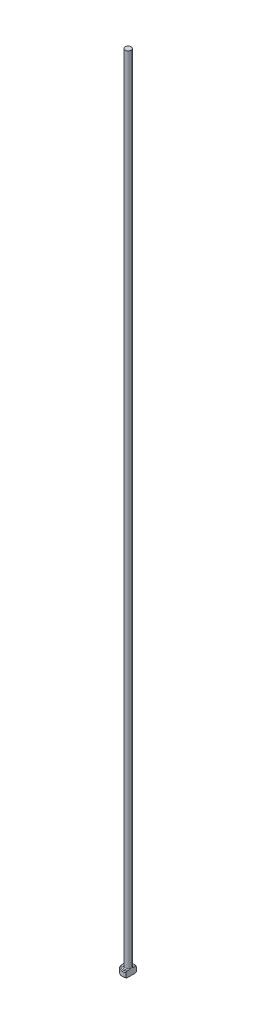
ISO-10303-21;
HEADER;
FILE_DESCRIPTION(('STEP AP214'),'2;1');
FILE_NAME('part.step','',(''),(''),'','','');
FILE_SCHEMA(('AUTOMOTIVE_DESIGN { 1 0 10303 214 1 1 1 1 }'));
ENDSEC;
DATA;
#1=APPLICATION_CONTEXT('core data for automotive mechanical design processes');
#2=APPLICATION_PROTOCOL_DEFINITION('international standard','automotive_design',2000,#1);
#3=PRODUCT_CONTEXT('',#1,'mechanical');
#4=PRODUCT('Part','Part','',(#3));
#5=PRODUCT_RELATED_PRODUCT_CATEGORY('part','',(#4));
#6=PRODUCT_DEFINITION_FORMATION('','',#4);
#7=PRODUCT_DEFINITION_CONTEXT('part definition',#1,'design');
#8=PRODUCT_DEFINITION('design','',#6,#7);
#9=PRODUCT_DEFINITION_SHAPE('','',#8);
#10=(LENGTH_UNIT() NAMED_UNIT(*) SI_UNIT(.MILLI.,.METRE.));
#11=(NAMED_UNIT(*) PLANE_ANGLE_UNIT() SI_UNIT($,.RADIAN.));
#12=(NAMED_UNIT(*) SI_UNIT($,.STERADIAN.) SOLID_ANGLE_UNIT());
#13=UNCERTAINTY_MEASURE_WITH_UNIT(LENGTH_MEASURE(1.E-05),#10,'distance_accuracy_value','');
#14=(GEOMETRIC_REPRESENTATION_CONTEXT(3) GLOBAL_UNCERTAINTY_ASSIGNED_CONTEXT((#13)) GLOBAL_UNIT_ASSIGNED_CONTEXT((#10,
#11,#12)) REPRESENTATION_CONTEXT('',''));
#15=CARTESIAN_POINT('',(0.,0.,0.));
#16=DIRECTION('',(0.,0.,1.));
#17=DIRECTION('',(1.,0.,0.));
#18=AXIS2_PLACEMENT_3D('',#15,#16,#17);
#19=CARTESIAN_POINT('',(0.,0.,0.));
#20=DIRECTION('',(0.,-1.,0.));
#21=DIRECTION('',(0.,0.,-1.));
#22=AXIS2_PLACEMENT_3D('',#19,#20,#21);
#23=PLANE('',#22);
#24=CARTESIAN_POINT('',(0.,0.,0.));
#25=DIRECTION('',(0.,-1.,0.));
#26=DIRECTION('',(0.,0.,-1.));
#27=AXIS2_PLACEMENT_3D('',#24,#25,#26);
#28=CIRCLE('',#27,1.29999999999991);
#29=CARTESIAN_POINT('',(0.749999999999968,0.,1.06183802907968));
#30=VERTEX_POINT('',#29);
#31=CARTESIAN_POINT('',(0.749999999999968,0.,-1.06183802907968));
#32=VERTEX_POINT('',#31);
#33=EDGE_CURVE('E98',#30,#32,#28,.T.);
#34=ORIENTED_EDGE('',*,*,#33,.T.);
#35=DIRECTION('',(0.,0.,1.));
#36=VECTOR('',#35,1.);
#37=CARTESIAN_POINT('',(0.749999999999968,0.,-1.29903810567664));
#38=LINE('',#37,#36);
#39=EDGE_CURVE('E83',#32,#30,#38,.T.);
#40=ORIENTED_EDGE('',*,*,#39,.T.);
#41=EDGE_LOOP('',(#34,#40));
#42=FACE_BOUND('',#41,.T.);
#43=ADVANCED_FACE('F32',(#42),#23,.T.);
#44=CARTESIAN_POINT('',(0.,259.958771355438,0.));
#45=DIRECTION('',(0.,1.,0.));
#46=DIRECTION('',(0.,0.,1.));
#47=AXIS2_PLACEMENT_3D('',#44,#45,#46);
#48=CYLINDRICAL_SURFACE('',#47,1.49999999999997);
#49=CARTESIAN_POINT('',(0.,1.30000000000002,0.));
#50=DIRECTION('',(0.,1.,0.));
#51=DIRECTION('',(0.,0.,1.));
#52=AXIS2_PLACEMENT_3D('',#49,#50,#51);
#53=CIRCLE('',#52,1.49999999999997);
#54=CARTESIAN_POINT('',(0.749999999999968,1.30000000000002,1.29903810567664));
#55=VERTEX_POINT('',#54);
#56=CARTESIAN_POINT('',(0.749999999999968,1.30000000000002,-1.29903810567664));
#57=VERTEX_POINT('',#56);
#58=EDGE_CURVE('E104',#55,#57,#53,.F.);
#59=ORIENTED_EDGE('',*,*,#58,.T.);
#60=DIRECTION('',(0.,-1.,0.));
#61=VECTOR('',#60,1.);
#62=CARTESIAN_POINT('',(0.749999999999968,200.,-1.29903810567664));
#63=LINE('',#62,#61);
#64=CARTESIAN_POINT('',(0.749999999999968,0.200000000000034,-1.29903810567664));
#65=VERTEX_POINT('',#64);
#66=EDGE_CURVE('E183',#57,#65,#63,.T.);
#67=ORIENTED_EDGE('',*,*,#66,.T.);
#68=CARTESIAN_POINT('',(0.,0.200000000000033,0.));
#69=DIRECTION('',(0.,-1.,0.));
#70=DIRECTION('',(0.,0.,-1.));
#71=AXIS2_PLACEMENT_3D('',#68,#69,#70);
#72=CIRCLE('',#71,1.49999999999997);
#73=CARTESIAN_POINT('',(0.749999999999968,0.200000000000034,1.29903810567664));
#74=VERTEX_POINT('',#73);
#75=EDGE_CURVE('E100',#65,#74,#72,.F.);
#76=ORIENTED_EDGE('',*,*,#75,.T.);
#77=DIRECTION('',(0.,-1.,0.));
#78=VECTOR('',#77,1.);
#79=CARTESIAN_POINT('',(0.749999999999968,200.,1.29903810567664));
#80=LINE('',#79,#78);
#81=EDGE_CURVE('E93',#55,#74,#80,.T.);
#82=ORIENTED_EDGE('',*,*,#81,.F.);
#83=EDGE_LOOP('',(#59,#67,#76,#82));
#84=FACE_BOUND('',#83,.T.);
#85=ADVANCED_FACE('F158',(#84),#48,.T.);
#86=CARTESIAN_POINT('',(-1.49999999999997,1.5,0.));
#87=DIRECTION('',(0.,1.,0.));
#88=DIRECTION('',(0.,0.,1.));
#89=AXIS2_PLACEMENT_3D('',#86,#87,#88);
#90=PLANE('',#89);
#91=CARTESIAN_POINT('',(0.,1.5,0.));
#92=DIRECTION('',(0.,1.,0.));
#93=DIRECTION('',(0.,0.,1.));
#94=AXIS2_PLACEMENT_3D('',#91,#92,#93);
#95=CIRCLE('',#94,1.30000000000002);
#96=CARTESIAN_POINT('',(0.749999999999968,1.5,-1.06183802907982));
#97=VERTEX_POINT('',#96);
#98=CARTESIAN_POINT('',(0.749999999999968,1.5,1.06183802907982));
#99=VERTEX_POINT('',#98);
#100=EDGE_CURVE('E178',#97,#99,#95,.T.);
#101=ORIENTED_EDGE('',*,*,#100,.T.);
#102=DIRECTION('',(0.,0.,-1.));
#103=VECTOR('',#102,1.);
#104=CARTESIAN_POINT('',(0.749999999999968,1.5,0.));
#105=LINE('',#104,#103);
#106=CARTESIAN_POINT('',(0.749999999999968,1.49999999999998,0.583095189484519));
#107=VERTEX_POINT('',#106);
#108=EDGE_CURVE('E57',#99,#107,#105,.T.);
#109=ORIENTED_EDGE('',*,*,#108,.T.);
#110=CARTESIAN_POINT('',(0.,1.5,0.));
#111=DIRECTION('',(0.,1.,0.));
#112=DIRECTION('',(0.,0.,1.));
#113=AXIS2_PLACEMENT_3D('',#110,#111,#112);
#114=CIRCLE('',#113,0.949999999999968);
#115=CARTESIAN_POINT('',(0.749999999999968,1.49999999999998,-0.583095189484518));
#116=VERTEX_POINT('',#115);
#117=EDGE_CURVE('E107',#107,#116,#114,.F.);
#118=ORIENTED_EDGE('',*,*,#117,.T.);
#119=EDGE_CURVE('E136',#116,#97,#105,.T.);
#120=ORIENTED_EDGE('',*,*,#119,.T.);
#121=EDGE_LOOP('',(#101,#109,#118,#120));
#122=FACE_BOUND('',#121,.T.);
#123=ADVANCED_FACE('F147',(#122),#90,.T.);
#124=CARTESIAN_POINT('',(0.,1.5,0.));
#125=DIRECTION('',(0.,-1.,0.));
#126=DIRECTION('',(0.,0.,-1.));
#127=AXIS2_PLACEMENT_3D('',#124,#125,#126);
#128=CONICAL_SURFACE('',#127,1.30000000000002,0.785398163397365);
#129=ORIENTED_EDGE('',*,*,#58,.F.);
#130=CARTESIAN_POINT('',(0.749999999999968,-0.159311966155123,2.86269581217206));
#131=CARTESIAN_POINT('',(0.749999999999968,-0.0964328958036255,2.79769204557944));
#132=CARTESIAN_POINT('',(0.749999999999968,-0.0336221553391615,2.73262201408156));
#133=CARTESIAN_POINT('',(0.749999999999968,0.0918244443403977,2.6023120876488));
#134=CARTESIAN_POINT('',(0.749999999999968,0.154460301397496,2.53707219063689));
#135=CARTESIAN_POINT('',(0.749999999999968,0.342109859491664,2.34097725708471));
#136=CARTESIAN_POINT('',(0.749999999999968,0.466801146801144,2.20981339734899));
#137=CARTESIAN_POINT('',(0.749999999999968,0.712328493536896,1.9488034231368));
#138=CARTESIAN_POINT('',(0.749999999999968,0.833191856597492,1.81898315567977));
#139=CARTESIAN_POINT('',(0.749999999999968,1.01264761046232,1.6225957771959));
#140=CARTESIAN_POINT('',(0.749999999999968,1.07215326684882,1.55686440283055));
#141=CARTESIAN_POINT('',(0.749999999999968,1.19029260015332,1.42462307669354));
#142=CARTESIAN_POINT('',(0.749999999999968,1.24892630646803,1.35811315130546));
#143=CARTESIAN_POINT('',(0.749999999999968,1.34237202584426,1.25003987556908));
#144=CARTESIAN_POINT('',(0.749999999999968,1.37758720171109,1.2088255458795));
#145=CARTESIAN_POINT('',(0.749999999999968,1.44738925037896,1.12585980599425));
#146=CARTESIAN_POINT('',(0.749999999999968,1.4819760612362,1.08410834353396));
#147=CARTESIAN_POINT('',(0.749999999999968,1.55066668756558,0.999475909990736));
#148=CARTESIAN_POINT('',(0.749999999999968,1.58476158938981,0.956587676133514));
#149=CARTESIAN_POINT('',(0.749999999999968,1.65176028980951,0.869892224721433));
#150=CARTESIAN_POINT('',(0.749999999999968,1.68466421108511,0.826085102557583));
#151=CARTESIAN_POINT('',(0.749999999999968,1.74926316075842,0.736563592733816));
#152=CARTESIAN_POINT('',(0.749999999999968,1.78093229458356,0.690830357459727));
#153=CARTESIAN_POINT('',(0.749999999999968,1.84170221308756,0.597569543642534));
#154=CARTESIAN_POINT('',(0.749999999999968,1.87079946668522,0.550039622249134));
#155=CARTESIAN_POINT('',(0.749999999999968,1.92458416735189,0.453275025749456));
#156=CARTESIAN_POINT('',(0.749999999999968,1.94932190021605,0.404068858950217));
#157=CARTESIAN_POINT('',(0.749999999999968,1.99240172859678,0.302953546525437));
#158=CARTESIAN_POINT('',(0.749999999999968,2.01076529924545,0.251054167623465));
#159=CARTESIAN_POINT('',(0.749999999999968,2.03062801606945,0.17321911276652));
#160=CARTESIAN_POINT('',(0.749999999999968,2.03589389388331,0.148243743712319));
#161=CARTESIAN_POINT('',(0.749999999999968,2.0440446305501,0.0979002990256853));
#162=CARTESIAN_POINT('',(0.749999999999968,2.04692969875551,0.0725322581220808));
#163=CARTESIAN_POINT('',(0.749999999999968,2.05011277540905,0.0217085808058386));
#164=CARTESIAN_POINT('',(0.749999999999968,2.05041870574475,-0.00374654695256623));
#165=CARTESIAN_POINT('',(0.749999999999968,2.04844884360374,-0.0545512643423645));
#166=CARTESIAN_POINT('',(0.749999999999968,2.04617283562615,-0.0799008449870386));
#167=CARTESIAN_POINT('',(0.749999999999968,2.03574038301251,-0.15498962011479));
#168=CARTESIAN_POINT('',(0.749999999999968,2.02400532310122,-0.204255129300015));
#169=CARTESIAN_POINT('',(0.749999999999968,2.00101199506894,-0.276434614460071));
#170=CARTESIAN_POINT('',(0.749999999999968,1.99241146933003,-0.300284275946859));
#171=CARTESIAN_POINT('',(0.749999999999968,1.97373056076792,-0.347397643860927));
#172=CARTESIAN_POINT('',(0.749999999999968,1.96365048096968,-0.370661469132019));
#173=CARTESIAN_POINT('',(0.749999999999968,1.93147369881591,-0.439916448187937));
#174=CARTESIAN_POINT('',(0.749999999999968,1.90754987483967,-0.485052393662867));
#175=CARTESIAN_POINT('',(0.749999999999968,1.85653851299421,-0.573518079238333));
#176=CARTESIAN_POINT('',(0.749999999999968,1.8294470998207,-0.616845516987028));
#177=CARTESIAN_POINT('',(0.749999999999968,1.77305281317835,-0.70224758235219));
#178=CARTESIAN_POINT('',(0.749999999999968,1.7437423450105,-0.744317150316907));
#179=CARTESIAN_POINT('',(0.749999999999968,1.68364081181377,-0.827390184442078));
#180=CARTESIAN_POINT('',(0.749999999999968,1.65284939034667,-0.868393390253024));
#181=CARTESIAN_POINT('',(0.749999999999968,1.55811585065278,-0.991236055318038));
#182=CARTESIAN_POINT('',(0.749999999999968,1.49256261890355,-1.07182756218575));
#183=CARTESIAN_POINT('',(0.749999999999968,1.35929153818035,-1.23084604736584));
#184=CARTESIAN_POINT('',(0.749999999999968,1.29157909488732,-1.30927763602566));
#185=CARTESIAN_POINT('',(0.749999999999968,1.16634991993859,-1.45163734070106));
#186=CARTESIAN_POINT('',(0.749999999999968,1.10905780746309,-1.51576342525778));
#187=CARTESIAN_POINT('',(0.749999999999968,0.993771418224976,-1.64338257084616));
#188=CARTESIAN_POINT('',(0.749999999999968,0.935777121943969,-1.70687561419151));
#189=CARTESIAN_POINT('',(0.749999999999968,0.760930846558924,-1.89677871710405));
#190=CARTESIAN_POINT('',(0.749999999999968,0.643323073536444,-2.02249209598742));
#191=CARTESIAN_POINT('',(0.749999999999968,0.411828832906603,-2.26768837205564));
#192=CARTESIAN_POINT('',(0.749999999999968,0.297988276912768,-2.38721485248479));
#193=CARTESIAN_POINT('',(0.749999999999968,0.0697231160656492,-2.62545352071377));
#194=CARTESIAN_POINT('',(0.749999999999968,-0.0447006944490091,-2.74416646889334));
#195=CARTESIAN_POINT('',(0.749999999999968,-0.159311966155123,-2.86269581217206));
#196=B_SPLINE_CURVE_WITH_KNOTS('',3,(#130,#131,#132,#133,#134,#135,#136,#137,#138,#139,#140,
#141,#142,#143,#144,#145,#146,#147,#148,#149,#150,#151,#152,#153,#154,#155,#156,#157,#158,#159,
#160,#161,#162,#163,#164,#165,#166,#167,#168,#169,#170,#171,#172,#173,#174,#175,#176,#177,#178,
#179,#180,#181,#182,#183,#184,#185,#186,#187,#188,#189,#190,#191,#192,#193,#194,#195),
.UNSPECIFIED.,.F.,.F.,(4,2,2,2,2,2,2,2,2,2,2,2,2,2,2,2,2,2,2,2,2,2,2,2,2,2,2,2,2,2,2,2,4),(0.,
0.271318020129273,0.54263937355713,1.08555961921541,1.61765797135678,1.88364922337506,
2.1496314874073,2.31225703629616,2.47489853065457,2.63925165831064,2.80358780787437,
2.97041571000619,3.13746921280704,3.30244771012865,3.46686485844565,3.54334114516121,
3.61981070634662,3.69604530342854,3.77228626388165,3.92333298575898,3.99936293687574,
4.07537733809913,4.22841106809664,4.38163402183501,4.53540740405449,4.68921798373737,
5.00077730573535,5.31160990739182,5.56957672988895,5.82755073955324,6.343983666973,
6.83917444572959,7.3338121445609),.UNSPECIFIED.);
#197=EDGE_CURVE('E135',#55,#99,#196,.T.);
#198=ORIENTED_EDGE('',*,*,#197,.T.);
#199=ORIENTED_EDGE('',*,*,#100,.F.);
#200=EDGE_CURVE('E127',#97,#57,#196,.T.);
#201=ORIENTED_EDGE('',*,*,#200,.T.);
#202=EDGE_LOOP('',(#129,#198,#199,#201));
#203=FACE_BOUND('',#202,.T.);
#204=ADVANCED_FACE('F143',(#203),#128,.T.);
#205=CARTESIAN_POINT('',(0.,0.200000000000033,0.));
#206=DIRECTION('',(0.,1.,0.));
#207=DIRECTION('',(0.,0.,1.));
#208=AXIS2_PLACEMENT_3D('',#205,#206,#207);
#209=CONICAL_SURFACE('',#208,1.49999999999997,0.785398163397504);
#210=ORIENTED_EDGE('',*,*,#75,.F.);
#211=CARTESIAN_POINT('',(0.749999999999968,1.65931196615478,-2.86269581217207));
#212=CARTESIAN_POINT('',(0.749999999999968,1.59643289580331,-2.79769204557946));
#213=CARTESIAN_POINT('',(0.749999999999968,1.53362215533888,-2.73262201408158));
#214=CARTESIAN_POINT('',(0.749999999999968,1.40817555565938,-2.60231208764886));
#215=CARTESIAN_POINT('',(0.749999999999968,1.34553969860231,-2.53707219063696));
#216=CARTESIAN_POINT('',(0.749999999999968,1.15789014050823,-2.34097725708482));
#217=CARTESIAN_POINT('',(0.749999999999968,1.03319885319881,-2.20981339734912));
#218=CARTESIAN_POINT('',(0.749999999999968,0.78767150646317,-1.94880342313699));
#219=CARTESIAN_POINT('',(0.749999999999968,0.666808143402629,-1.81898315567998));
#220=CARTESIAN_POINT('',(0.749999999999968,0.487352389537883,-1.62259577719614));
#221=CARTESIAN_POINT('',(0.749999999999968,0.427846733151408,-1.55686440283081));
#222=CARTESIAN_POINT('',(0.749999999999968,0.309707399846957,-1.42462307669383));
#223=CARTESIAN_POINT('',(0.749999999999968,0.251073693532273,-1.35811315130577));
#224=CARTESIAN_POINT('',(0.749999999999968,0.15762797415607,-1.25003987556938));
#225=CARTESIAN_POINT('',(0.749999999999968,0.122412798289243,-1.2088255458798));
#226=CARTESIAN_POINT('',(0.749999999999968,0.0526107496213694,-1.12585980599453));
#227=CARTESIAN_POINT('',(0.749999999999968,0.0180239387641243,-1.08410834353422));
#228=CARTESIAN_POINT('',(0.749999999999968,-0.0506666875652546,-0.999475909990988));
#229=CARTESIAN_POINT('',(0.749999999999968,-0.0847615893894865,-0.956587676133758));
#230=CARTESIAN_POINT('',(0.749999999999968,-0.151760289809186,-0.86989222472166));
#231=CARTESIAN_POINT('',(0.749999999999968,-0.18466421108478,-0.826085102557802));
#232=CARTESIAN_POINT('',(0.749999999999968,-0.249263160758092,-0.73656359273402));
#233=CARTESIAN_POINT('',(0.749999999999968,-0.280932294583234,-0.690830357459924));
#234=CARTESIAN_POINT('',(0.749999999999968,-0.341702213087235,-0.597569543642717));
#235=CARTESIAN_POINT('',(0.749999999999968,-0.370799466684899,-0.550039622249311));
#236=CARTESIAN_POINT('',(0.749999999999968,-0.424584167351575,-0.453275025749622));
#237=CARTESIAN_POINT('',(0.749999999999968,-0.449321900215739,-0.404068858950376));
#238=CARTESIAN_POINT('',(0.749999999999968,-0.492401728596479,-0.302953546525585));
#239=CARTESIAN_POINT('',(0.749999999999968,-0.510765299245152,-0.251054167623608));
#240=CARTESIAN_POINT('',(0.749999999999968,-0.530628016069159,-0.173219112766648));
#241=CARTESIAN_POINT('',(0.749999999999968,-0.535893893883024,-0.148243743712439));
#242=CARTESIAN_POINT('',(0.749999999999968,-0.544044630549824,-0.0979002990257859));
#243=CARTESIAN_POINT('',(0.749999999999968,-0.546929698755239,-0.0725322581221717));
#244=CARTESIAN_POINT('',(0.749999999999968,-0.550112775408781,-0.0217085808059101));
#245=CARTESIAN_POINT('',(0.749999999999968,-0.550418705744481,0.00374654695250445));
#246=CARTESIAN_POINT('',(0.749999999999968,-0.548448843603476,0.0545512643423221));
#247=CARTESIAN_POINT('',(0.749999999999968,-0.546172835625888,0.0799008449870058));
#248=CARTESIAN_POINT('',(0.749999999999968,-0.535740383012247,0.154989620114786));
#249=CARTESIAN_POINT('',(0.749999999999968,-0.524005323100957,0.204255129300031));
#250=CARTESIAN_POINT('',(0.749999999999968,-0.501011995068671,0.276434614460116));
#251=CARTESIAN_POINT('',(0.749999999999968,-0.492411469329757,0.300284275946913));
#252=CARTESIAN_POINT('',(0.749999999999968,-0.473730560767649,0.347397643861));
#253=CARTESIAN_POINT('',(0.749999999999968,-0.463650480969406,0.370661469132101));
#254=CARTESIAN_POINT('',(0.749999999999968,-0.431473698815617,0.43991644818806));
#255=CARTESIAN_POINT('',(0.749999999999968,-0.407549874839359,0.485052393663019));
#256=CARTESIAN_POINT('',(0.749999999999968,-0.356538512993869,0.573518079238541));
#257=CARTESIAN_POINT('',(0.749999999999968,-0.329447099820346,0.616845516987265));
#258=CARTESIAN_POINT('',(0.749999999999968,-0.273052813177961,0.702247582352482));
#259=CARTESIAN_POINT('',(0.749999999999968,-0.243742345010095,0.744317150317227));
#260=CARTESIAN_POINT('',(0.749999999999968,-0.183640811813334,0.827390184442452));
#261=CARTESIAN_POINT('',(0.749999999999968,-0.152849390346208,0.868393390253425));
#262=CARTESIAN_POINT('',(0.749999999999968,-0.0581158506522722,0.991236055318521));
#263=CARTESIAN_POINT('',(0.749999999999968,0.00743738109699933,1.07182756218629));
#264=CARTESIAN_POINT('',(0.749999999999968,0.140708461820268,1.23084604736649));
#265=CARTESIAN_POINT('',(0.749999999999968,0.208420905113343,1.30927763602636));
#266=CARTESIAN_POINT('',(0.749999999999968,0.333650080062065,1.45163734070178));
#267=CARTESIAN_POINT('',(0.749999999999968,0.390942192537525,1.51576342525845));
#268=CARTESIAN_POINT('',(0.749999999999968,0.506228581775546,1.64338257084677));
#269=CARTESIAN_POINT('',(0.749999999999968,0.564222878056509,1.70687561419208));
#270=CARTESIAN_POINT('',(0.749999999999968,0.739069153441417,1.89677871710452));
#271=CARTESIAN_POINT('',(0.749999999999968,0.856676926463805,2.02249209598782));
#272=CARTESIAN_POINT('',(0.749999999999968,1.08817116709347,2.26768837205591));
#273=CARTESIAN_POINT('',(0.749999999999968,1.20201172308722,2.38721485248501));
#274=CARTESIAN_POINT('',(0.749999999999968,1.43027688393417,2.62545352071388));
#275=CARTESIAN_POINT('',(0.749999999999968,1.54470069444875,2.7441664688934));
#276=CARTESIAN_POINT('',(0.749999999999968,1.65931196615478,2.86269581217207));
#277=B_SPLINE_CURVE_WITH_KNOTS('',3,(#211,#212,#213,#214,#215,#216,#217,#218,#219,#220,#221,
#222,#223,#224,#225,#226,#227,#228,#229,#230,#231,#232,#233,#234,#235,#236,#237,#238,#239,#240,
#241,#242,#243,#244,#245,#246,#247,#248,#249,#250,#251,#252,#253,#254,#255,#256,#257,#258,#259,
#260,#261,#262,#263,#264,#265,#266,#267,#268,#269,#270,#271,#272,#273,#274,#275,#276),
.UNSPECIFIED.,.F.,.F.,(4,2,2,2,2,2,2,2,2,2,2,2,2,2,2,2,2,2,2,2,2,2,2,2,2,2,2,2,2,2,2,2,4),(0.,
0.271318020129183,0.54263937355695,1.08555961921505,1.61765797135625,1.88364922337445,
2.14963148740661,2.31225703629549,2.47489853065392,2.63925165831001,2.80358780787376,
2.97041571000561,3.13746921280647,3.3024477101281,3.46686485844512,3.54334114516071,
3.61981070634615,3.6960453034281,3.77228626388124,3.92333298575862,3.99936293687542,
4.07537733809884,4.22841106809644,4.38163402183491,4.53540740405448,4.68921798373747,
5.00077730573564,5.3116099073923,5.56957672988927,5.82755073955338,6.34398366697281,
6.8391744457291,7.33381214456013),.UNSPECIFIED.);
#278=EDGE_CURVE('E86',#65,#32,#277,.T.);
#279=ORIENTED_EDGE('',*,*,#278,.T.);
#280=ORIENTED_EDGE('',*,*,#33,.F.);
#281=EDGE_CURVE('E89',#30,#74,#277,.T.);
#282=ORIENTED_EDGE('',*,*,#281,.T.);
#283=EDGE_LOOP('',(#210,#279,#280,#282));
#284=FACE_BOUND('',#283,.T.);
#285=ADVANCED_FACE('F97',(#284),#209,.T.);
#286=CARTESIAN_POINT('',(0.,1.69999999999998,0.));
#287=DIRECTION('',(0.,1.,0.));
#288=DIRECTION('',(0.,0.,1.));
#289=AXIS2_PLACEMENT_3D('',#286,#287,#288);
#290=TOROIDAL_SURFACE('',#289,0.949999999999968,0.2);
#291=CARTESIAN_POINT('',(0.749999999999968,1.69999999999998,0.));
#292=CARTESIAN_POINT('',(0.749999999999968,1.70000052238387,0.));
#293=CARTESIAN_POINT('',(0.749999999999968,1.70000104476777,-7.92518426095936E-08));
#294=CARTESIAN_POINT('',(0.749999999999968,1.70000206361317,-3.45345029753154E-07));
#295=CARTESIAN_POINT('',(0.749999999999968,1.70000255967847,-5.3349315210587E-07));
#296=CARTESIAN_POINT('',(0.749999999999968,1.70000354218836,-9.91557921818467E-07));
#297=CARTESIAN_POINT('',(0.749999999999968,1.70000402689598,-1.26510931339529E-06));
#298=CARTESIAN_POINT('',(0.749999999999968,1.70000495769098,-1.86638896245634E-06));
#299=CARTESIAN_POINT('',(0.749999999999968,1.70000540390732,-2.19392466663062E-06));
#300=CARTESIAN_POINT('',(0.749999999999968,1.70000683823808,-3.33370952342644E-06));
#301=CARTESIAN_POINT('',(0.749999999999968,1.70000776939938,-4.21820142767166E-06));
#302=CARTESIAN_POINT('',(0.749999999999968,1.70000948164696,-6.08403165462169E-06));
#303=CARTESIAN_POINT('',(0.749999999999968,1.70001026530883,-7.06314143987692E-06));
#304=CARTESIAN_POINT('',(0.749999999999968,1.70001305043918,-1.07283299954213E-05));
#305=CARTESIAN_POINT('',(0.749999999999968,1.70001489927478,-1.35334970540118E-05));
#306=CARTESIAN_POINT('',(0.749999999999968,1.70001806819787,-1.91887701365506E-05));
#307=CARTESIAN_POINT('',(0.749999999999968,1.70001941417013,-2.20250297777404E-05));
#308=CARTESIAN_POINT('',(0.749999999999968,1.700024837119,-3.36357626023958E-05));
#309=CARTESIAN_POINT('',(0.749999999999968,1.70002876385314,-4.24755661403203E-05));
#310=CARTESIAN_POINT('',(0.749999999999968,1.70003535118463,-5.93015818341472E-05));
#311=CARTESIAN_POINT('',(0.749999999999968,1.70003811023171,-6.72480836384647E-05));
#312=CARTESIAN_POINT('',(0.749999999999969,1.70005910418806,-0.000122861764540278));
#313=CARTESIAN_POINT('',(0.749999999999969,1.7000847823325,-0.000167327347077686));
#314=CARTESIAN_POINT('',(0.749999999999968,1.70017912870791,-0.000337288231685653));
#315=CARTESIAN_POINT('',(0.749999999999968,1.70024226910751,-0.000465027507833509));
#316=CARTESIAN_POINT('',(0.749999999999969,1.70048606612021,-0.000950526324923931));
#317=CARTESIAN_POINT('',(0.749999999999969,1.70067249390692,-0.00130597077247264));
#318=CARTESIAN_POINT('',(0.749999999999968,1.70141452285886,-0.00272815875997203));
#319=CARTESIAN_POINT('',(0.749999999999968,1.70196367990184,-0.00379745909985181));
#320=CARTESIAN_POINT('',(0.749999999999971,1.71079317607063,-0.0209810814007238));
#321=CARTESIAN_POINT('',(0.749999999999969,1.71912708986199,-0.0370747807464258));
#322=CARTESIAN_POINT('',(0.749999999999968,1.7353816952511,-0.068794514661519));
#323=CARTESIAN_POINT('',(0.749999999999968,1.74330692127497,-0.0844183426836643));
#324=CARTESIAN_POINT('',(0.749999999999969,1.75980152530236,-0.11741223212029));
#325=CARTESIAN_POINT('',(0.749999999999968,1.76835063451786,-0.134792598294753));
#326=CARTESIAN_POINT('',(0.749999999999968,1.7851625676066,-0.169887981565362));
#327=CARTESIAN_POINT('',(0.749999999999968,1.79342203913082,-0.187604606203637));
#328=CARTESIAN_POINT('',(0.749999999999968,1.81367684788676,-0.232718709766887));
#329=CARTESIAN_POINT('',(0.749999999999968,1.82533268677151,-0.260271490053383));
#330=CARTESIAN_POINT('',(0.749999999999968,1.84666110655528,-0.315501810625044));
#331=CARTESIAN_POINT('',(0.749999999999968,1.85636938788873,-0.34316526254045));
#332=CARTESIAN_POINT('',(0.749999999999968,1.87268127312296,-0.396748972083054));
#333=CARTESIAN_POINT('',(0.749999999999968,1.87948325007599,-0.42260763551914));
#334=CARTESIAN_POINT('',(0.749999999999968,1.89076706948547,-0.476103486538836));
#335=CARTESIAN_POINT('',(0.749999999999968,1.89512718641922,-0.50376764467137));
#336=CARTESIAN_POINT('',(0.749999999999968,1.90012258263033,-0.559350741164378));
#337=CARTESIAN_POINT('',(0.749999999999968,1.90077276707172,-0.587268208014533));
#338=CARTESIAN_POINT('',(0.749999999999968,1.8972553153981,-0.64249646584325));
#339=CARTESIAN_POINT('',(0.749999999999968,1.89315871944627,-0.669810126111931));
#340=CARTESIAN_POINT('',(0.749999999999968,1.88226759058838,-0.710376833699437));
#341=CARTESIAN_POINT('',(0.749999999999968,1.87764112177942,-0.724213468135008));
#342=CARTESIAN_POINT('',(0.749999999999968,1.8664543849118,-0.751128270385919));
#343=CARTESIAN_POINT('',(0.749999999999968,1.85989169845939,-0.764205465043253));
#344=CARTESIAN_POINT('',(0.749999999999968,1.84591711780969,-0.787020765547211));
#345=CARTESIAN_POINT('',(0.749999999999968,1.83882518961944,-0.796953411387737));
#346=CARTESIAN_POINT('',(0.749999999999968,1.82312129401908,-0.815534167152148));
#347=CARTESIAN_POINT('',(0.749999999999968,1.81451194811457,-0.824184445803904));
#348=CARTESIAN_POINT('',(0.749999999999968,1.79770708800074,-0.838172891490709));
#349=CARTESIAN_POINT('',(0.749999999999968,1.78977561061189,-0.84382734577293));
#350=CARTESIAN_POINT('',(0.749999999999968,1.77308433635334,-0.853755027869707));
#351=CARTESIAN_POINT('',(0.749999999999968,1.76432487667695,-0.858028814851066));
#352=CARTESIAN_POINT('',(0.749999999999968,1.74611994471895,-0.864966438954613));
#353=CARTESIAN_POINT('',(0.749999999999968,1.73667052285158,-0.867620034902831));
#354=CARTESIAN_POINT('',(0.749999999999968,1.71743927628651,-0.871086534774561));
#355=CARTESIAN_POINT('',(0.749999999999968,1.70765762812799,-0.871900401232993));
#356=CARTESIAN_POINT('',(0.749999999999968,1.68916476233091,-0.871644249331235));
#357=CARTESIAN_POINT('',(0.749999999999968,1.68045031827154,-0.870765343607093));
#358=CARTESIAN_POINT('',(0.749999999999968,1.66329782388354,-0.867547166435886));
#359=CARTESIAN_POINT('',(0.749999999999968,1.65485975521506,-0.865207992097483));
#360=CARTESIAN_POINT('',(0.749999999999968,1.63851016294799,-0.859212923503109));
#361=CARTESIAN_POINT('',(0.749999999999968,1.63059660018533,-0.855562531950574));
#362=CARTESIAN_POINT('',(0.749999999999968,1.61540880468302,-0.847119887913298));
#363=CARTESIAN_POINT('',(0.749999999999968,1.60813470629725,-0.842327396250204));
#364=CARTESIAN_POINT('',(0.749999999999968,1.59350795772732,-0.831172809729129));
#365=CARTESIAN_POINT('',(0.749999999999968,1.58624574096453,-0.82469266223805));
#366=CARTESIAN_POINT('',(0.749999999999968,1.57268239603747,-0.810794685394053));
#367=CARTESIAN_POINT('',(0.749999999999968,1.56638225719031,-0.803375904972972));
#368=CARTESIAN_POINT('',(0.749999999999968,1.55147186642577,-0.783446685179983));
#369=CARTESIAN_POINT('',(0.749999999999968,1.54355238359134,-0.770417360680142));
#370=CARTESIAN_POINT('',(0.749999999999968,1.52991429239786,-0.743286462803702));
#371=CARTESIAN_POINT('',(0.749999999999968,1.52419651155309,-0.729184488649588));
#372=CARTESIAN_POINT('',(0.749999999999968,1.51257018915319,-0.693822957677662));
#373=CARTESIAN_POINT('',(0.749999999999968,1.50774380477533,-0.672209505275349));
#374=CARTESIAN_POINT('',(0.749999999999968,1.50145191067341,-0.628298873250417));
#375=CARTESIAN_POINT('',(0.749999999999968,1.5000267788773,-0.605996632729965));
#376=CARTESIAN_POINT('',(0.749999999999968,1.49995578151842,-0.546111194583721));
#377=CARTESIAN_POINT('',(0.749999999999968,1.50388309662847,-0.508527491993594));
#378=CARTESIAN_POINT('',(0.749999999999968,1.51373246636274,-0.453837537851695));
#379=CARTESIAN_POINT('',(0.749999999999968,1.51754666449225,-0.436272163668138));
#380=CARTESIAN_POINT('',(0.749999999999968,1.52621031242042,-0.401484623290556));
#381=CARTESIAN_POINT('',(0.749999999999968,1.53105449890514,-0.384261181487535));
#382=CARTESIAN_POINT('',(0.749999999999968,1.54486296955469,-0.339542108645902));
#383=CARTESIAN_POINT('',(0.749999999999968,1.55452531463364,-0.312264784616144));
#384=CARTESIAN_POINT('',(0.749999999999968,1.57570310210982,-0.257776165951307));
#385=CARTESIAN_POINT('',(0.749999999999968,1.58725400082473,-0.230578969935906));
#386=CARTESIAN_POINT('',(0.749999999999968,1.60733071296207,-0.18597536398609));
#387=CARTESIAN_POINT('',(0.749999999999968,1.6155301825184,-0.168419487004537));
#388=CARTESIAN_POINT('',(0.749999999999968,1.63221303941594,-0.133639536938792));
#389=CARTESIAN_POINT('',(0.749999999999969,1.64069316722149,-0.116413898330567));
#390=CARTESIAN_POINT('',(0.749999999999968,1.65705001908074,-0.0837133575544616));
#391=CARTESIAN_POINT('',(0.749999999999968,1.66490699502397,-0.0682284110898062));
#392=CARTESIAN_POINT('',(0.749999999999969,1.68101978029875,-0.0367899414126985));
#393=CARTESIAN_POINT('',(0.749999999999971,1.68928002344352,-0.0208385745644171));
#394=CARTESIAN_POINT('',(0.749999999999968,1.69803632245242,-0.00379745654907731));
#395=CARTESIAN_POINT('',(0.749999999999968,1.69858548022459,-0.00272815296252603));
#396=CARTESIAN_POINT('',(0.749999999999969,1.69932750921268,-0.00130596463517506));
#397=CARTESIAN_POINT('',(0.749999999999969,1.69951393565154,-0.000950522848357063));
#398=CARTESIAN_POINT('',(0.749999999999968,1.69975773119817,-0.000465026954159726));
#399=CARTESIAN_POINT('',(0.749999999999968,1.6998208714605,-0.000337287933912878));
#400=CARTESIAN_POINT('',(0.749999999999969,1.69991521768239,-0.00016732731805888));
#401=CARTESIAN_POINT('',(0.749999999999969,1.69994089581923,-0.000122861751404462));
#402=CARTESIAN_POINT('',(0.749999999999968,1.69996188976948,-6.72480869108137E-05));
#403=CARTESIAN_POINT('',(0.749999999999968,1.69996464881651,-5.93015849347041E-05));
#404=CARTESIAN_POINT('',(0.749999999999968,1.6999712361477,-4.24755687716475E-05));
#405=CARTESIAN_POINT('',(0.749999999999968,1.69997516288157,-3.36357649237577E-05));
#406=CARTESIAN_POINT('',(0.749999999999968,1.69998058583,-2.20250315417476E-05));
#407=CARTESIAN_POINT('',(0.749999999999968,1.69998193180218,-1.91887716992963E-05));
#408=CARTESIAN_POINT('',(0.749999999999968,1.69998510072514,-1.35334981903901E-05));
#409=CARTESIAN_POINT('',(0.749999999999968,1.69998694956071,-1.07283309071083E-05));
#410=CARTESIAN_POINT('',(0.749999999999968,1.69998973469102,-7.06314205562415E-06));
#411=CARTESIAN_POINT('',(0.749999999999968,1.69999051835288,-6.08403219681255E-06));
#412=CARTESIAN_POINT('',(0.749999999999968,1.69999223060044,-4.21820182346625E-06));
#413=CARTESIAN_POINT('',(0.749999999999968,1.69999316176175,-3.33370984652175E-06));
#414=CARTESIAN_POINT('',(0.749999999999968,1.69999459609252,-2.19392489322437E-06));
#415=CARTESIAN_POINT('',(0.749999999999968,1.69999504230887,-1.86638916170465E-06));
#416=CARTESIAN_POINT('',(0.749999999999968,1.69999597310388,-1.26510946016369E-06));
#417=CARTESIAN_POINT('',(0.749999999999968,1.69999645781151,-9.91558043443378E-07));
#418=CARTESIAN_POINT('',(0.749999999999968,1.69999744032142,-5.33493228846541E-07));
#419=CARTESIAN_POINT('',(0.749999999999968,1.69999793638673,-3.453450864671E-07));
#420=CARTESIAN_POINT('',(0.749999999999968,1.69999895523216,-7.92518654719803E-08));
#421=CARTESIAN_POINT('',(0.749999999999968,1.69999947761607,0.));
#422=CARTESIAN_POINT('',(0.749999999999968,1.69999999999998,0.));
#423=B_SPLINE_CURVE_WITH_KNOTS('',3,(#291,#292,#293,#294,#295,#296,#297,#298,#299,#300,#301,
#302,#303,#304,#305,#306,#307,#308,#309,#310,#311,#312,#313,#314,#315,#316,#317,#318,#319,#320,
#321,#322,#323,#324,#325,#326,#327,#328,#329,#330,#331,#332,#333,#334,#335,#336,#337,#338,#339,
#340,#341,#342,#343,#344,#345,#346,#347,#348,#349,#350,#351,#352,#353,#354,#355,#356,#357,#358,
#359,#360,#361,#362,#363,#364,#365,#366,#367,#368,#369,#370,#371,#372,#373,#374,#375,#376,#377,
#378,#379,#380,#381,#382,#383,#384,#385,#386,#387,#388,#389,#390,#391,#392,#393,#394,#395,#396,
#397,#398,#399,#400,#401,#402,#403,#404,#405,#406,#407,#408,#409,#410,#411,#412,#413,#414,#415,
#416,#417,#418,#419,#420,#421,#422),.UNSPECIFIED.,.T.,.F.,(4,2,2,2,2,2,2,2,2,2,2,2,2,2,2,2,2,2,
2,2,2,2,2,2,2,2,2,2,2,2,2,2,2,2,2,2,2,2,2,2,2,2,2,2,2,2,2,2,2,2,2,2,2,2,2,2,2,2,2,2,2,2,2,2,2,
4),(0.,1.56543920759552E-06,3.1500654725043E-06,4.81434344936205E-06,6.47280881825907E-06,
1.03067366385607E-05,1.4065794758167E-05,2.41046688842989E-05,3.35140857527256E-05,
6.25197196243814E-05,8.77289706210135E-05,0.000240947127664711,0.000669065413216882,
0.00187238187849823,0.00547938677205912,0.0598417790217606,0.112399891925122,0.170503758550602,
0.229141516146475,0.318850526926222,0.406723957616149,0.486842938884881,0.570663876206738,
0.654147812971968,0.736398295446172,0.780052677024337,0.823761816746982,0.860241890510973,
0.896659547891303,0.925764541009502,0.954857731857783,0.98413296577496,1.01339287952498,
1.03954157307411,1.06568852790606,1.09172701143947,1.11777095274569,1.14686281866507,
1.17598440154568,1.22146737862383,1.26696743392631,1.33303548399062,1.39988404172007,
1.51253340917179,1.56644503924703,1.62008752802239,1.70682485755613,1.79543193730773,
1.85355663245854,1.91115281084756,1.96324672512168,2.01712839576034,2.02073541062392,
2.02193871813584,2.02236683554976,2.02252005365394,2.02254526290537,2.02257426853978,
2.02258367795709,2.02259371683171,2.02259747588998,2.02260130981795,2.02260296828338,
2.02260463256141,2.02260621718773,2.02260778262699),.UNSPECIFIED.);
#424=CARTESIAN_POINT('',(0.749999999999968,1.69999999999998,0.));
#425=VERTEX_POINT('',#424);
#426=EDGE_CURVE('E11',#116,#425,#423,.T.);
#427=ORIENTED_EDGE('',*,*,#426,.F.);
#428=ORIENTED_EDGE('',*,*,#117,.F.);
#429=CARTESIAN_POINT('',(0.749999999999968,1.69999999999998,0.));
#430=CARTESIAN_POINT('',(0.749999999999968,1.69999947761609,0.));
#431=CARTESIAN_POINT('',(0.749999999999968,1.69999895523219,7.92518426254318E-08));
#432=CARTESIAN_POINT('',(0.749999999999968,1.69999793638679,3.45345029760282E-07));
#433=CARTESIAN_POINT('',(0.749999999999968,1.69999744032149,5.33493152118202E-07));
#434=CARTESIAN_POINT('',(0.749999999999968,1.6999964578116,9.91557921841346E-07));
#435=CARTESIAN_POINT('',(0.749999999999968,1.69999597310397,1.26510931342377E-06));
#436=CARTESIAN_POINT('',(0.749999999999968,1.69999504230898,1.86638896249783E-06));
#437=CARTESIAN_POINT('',(0.749999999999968,1.69999459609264,2.19392466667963E-06));
#438=CARTESIAN_POINT('',(0.749999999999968,1.69999316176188,3.33370952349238E-06));
#439=CARTESIAN_POINT('',(0.749999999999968,1.69999223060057,4.21820142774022E-06));
#440=CARTESIAN_POINT('',(0.749999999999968,1.699990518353,6.08403165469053E-06));
#441=CARTESIAN_POINT('',(0.749999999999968,1.69998973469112,7.06314143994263E-06));
#442=CARTESIAN_POINT('',(0.749999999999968,1.69998694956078,1.07283299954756E-05));
#443=CARTESIAN_POINT('',(0.749999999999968,1.69998510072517,1.35334970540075E-05));
#444=CARTESIAN_POINT('',(0.749999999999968,1.69998193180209,1.91887701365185E-05));
#445=CARTESIAN_POINT('',(0.749999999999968,1.69998058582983,2.20250297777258E-05));
#446=CARTESIAN_POINT('',(0.749999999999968,1.69997516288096,3.36357626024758E-05));
#447=CARTESIAN_POINT('',(0.749999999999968,1.69997123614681,4.24755661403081E-05));
#448=CARTESIAN_POINT('',(0.749999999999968,1.69996464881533,5.93015818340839E-05));
#449=CARTESIAN_POINT('',(0.749999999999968,1.69996188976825,6.72480836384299E-05));
#450=CARTESIAN_POINT('',(0.749999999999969,1.6999408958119,0.000122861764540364));
#451=CARTESIAN_POINT('',(0.749999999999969,1.69991521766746,0.00016732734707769));
#452=CARTESIAN_POINT('',(0.749999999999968,1.69982087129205,0.000337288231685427));
#453=CARTESIAN_POINT('',(0.749999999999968,1.69975773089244,0.000465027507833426));
#454=CARTESIAN_POINT('',(0.749999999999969,1.69951393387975,0.000950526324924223));
#455=CARTESIAN_POINT('',(0.749999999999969,1.69932750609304,0.00130597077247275));
#456=CARTESIAN_POINT('',(0.749999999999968,1.6985854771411,0.00272815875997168));
#457=CARTESIAN_POINT('',(0.749999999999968,1.69803632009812,0.00379745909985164));
#458=CARTESIAN_POINT('',(0.749999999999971,1.68920682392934,0.0209810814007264));
#459=CARTESIAN_POINT('',(0.749999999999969,1.68087291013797,0.0370747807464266));
#460=CARTESIAN_POINT('',(0.749999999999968,1.66461830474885,0.0687945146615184));
#461=CARTESIAN_POINT('',(0.749999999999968,1.65669307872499,0.0844183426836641));
#462=CARTESIAN_POINT('',(0.749999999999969,1.6401984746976,0.11741223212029));
#463=CARTESIAN_POINT('',(0.749999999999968,1.6316493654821,0.134792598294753));
#464=CARTESIAN_POINT('',(0.749999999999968,1.61483743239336,0.169887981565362));
#465=CARTESIAN_POINT('',(0.749999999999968,1.60657796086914,0.187604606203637));
#466=CARTESIAN_POINT('',(0.749999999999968,1.5863231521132,0.232718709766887));
#467=CARTESIAN_POINT('',(0.749999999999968,1.57466731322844,0.260271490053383));
#468=CARTESIAN_POINT('',(0.749999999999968,1.55333889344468,0.315501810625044));
#469=CARTESIAN_POINT('',(0.749999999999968,1.54363061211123,0.34316526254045));
#470=CARTESIAN_POINT('',(0.749999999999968,1.52731872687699,0.396748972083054));
#471=CARTESIAN_POINT('',(0.749999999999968,1.52051674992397,0.42260763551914));
#472=CARTESIAN_POINT('',(0.749999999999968,1.50923293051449,0.476103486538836));
#473=CARTESIAN_POINT('',(0.749999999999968,1.50487281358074,0.50376764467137));
#474=CARTESIAN_POINT('',(0.749999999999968,1.49987741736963,0.559350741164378));
#475=CARTESIAN_POINT('',(0.749999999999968,1.49922723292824,0.587268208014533));
#476=CARTESIAN_POINT('',(0.749999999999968,1.50274468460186,0.64249646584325));
#477=CARTESIAN_POINT('',(0.749999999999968,1.50684128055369,0.669810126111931));
#478=CARTESIAN_POINT('',(0.749999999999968,1.51773240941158,0.710376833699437));
#479=CARTESIAN_POINT('',(0.749999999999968,1.52235887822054,0.724213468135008));
#480=CARTESIAN_POINT('',(0.749999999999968,1.53354561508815,0.751128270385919));
#481=CARTESIAN_POINT('',(0.749999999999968,1.54010830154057,0.764205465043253));
#482=CARTESIAN_POINT('',(0.749999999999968,1.55408288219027,0.787020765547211));
#483=CARTESIAN_POINT('',(0.749999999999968,1.56117481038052,0.796953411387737));
#484=CARTESIAN_POINT('',(0.749999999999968,1.57687870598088,0.815534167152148));
#485=CARTESIAN_POINT('',(0.749999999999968,1.58548805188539,0.824184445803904));
#486=CARTESIAN_POINT('',(0.749999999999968,1.60229291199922,0.838172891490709));
#487=CARTESIAN_POINT('',(0.749999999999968,1.61022438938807,0.84382734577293));
#488=CARTESIAN_POINT('',(0.749999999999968,1.62691566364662,0.853755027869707));
#489=CARTESIAN_POINT('',(0.749999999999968,1.635675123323,0.858028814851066));
#490=CARTESIAN_POINT('',(0.749999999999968,1.653880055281,0.864966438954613));
#491=CARTESIAN_POINT('',(0.749999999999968,1.66332947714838,0.867620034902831));
#492=CARTESIAN_POINT('',(0.749999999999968,1.68256072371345,0.871086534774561));
#493=CARTESIAN_POINT('',(0.749999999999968,1.69234237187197,0.871900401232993));
#494=CARTESIAN_POINT('',(0.749999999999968,1.71083523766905,0.871644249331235));
#495=CARTESIAN_POINT('',(0.749999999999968,1.71954968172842,0.870765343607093));
#496=CARTESIAN_POINT('',(0.749999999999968,1.73670217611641,0.867547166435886));
#497=CARTESIAN_POINT('',(0.749999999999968,1.7451402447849,0.865207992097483));
#498=CARTESIAN_POINT('',(0.749999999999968,1.76148983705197,0.859212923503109));
#499=CARTESIAN_POINT('',(0.749999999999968,1.76940339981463,0.855562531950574));
#500=CARTESIAN_POINT('',(0.749999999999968,1.78459119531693,0.847119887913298));
#501=CARTESIAN_POINT('',(0.749999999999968,1.7918652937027,0.842327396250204));
#502=CARTESIAN_POINT('',(0.749999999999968,1.80649204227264,0.831172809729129));
#503=CARTESIAN_POINT('',(0.749999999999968,1.81375425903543,0.82469266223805));
#504=CARTESIAN_POINT('',(0.749999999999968,1.82731760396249,0.810794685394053));
#505=CARTESIAN_POINT('',(0.749999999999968,1.83361774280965,0.803375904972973));
#506=CARTESIAN_POINT('',(0.749999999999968,1.84852813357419,0.783446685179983));
#507=CARTESIAN_POINT('',(0.749999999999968,1.85644761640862,0.770417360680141));
#508=CARTESIAN_POINT('',(0.749999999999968,1.8700857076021,0.743286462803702));
#509=CARTESIAN_POINT('',(0.749999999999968,1.87580348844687,0.729184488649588));
#510=CARTESIAN_POINT('',(0.749999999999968,1.88742981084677,0.693822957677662));
#511=CARTESIAN_POINT('',(0.749999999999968,1.89225619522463,0.672209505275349));
#512=CARTESIAN_POINT('',(0.749999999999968,1.89854808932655,0.628298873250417));
#513=CARTESIAN_POINT('',(0.749999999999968,1.89997322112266,0.605996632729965));
#514=CARTESIAN_POINT('',(0.749999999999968,1.90004421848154,0.546111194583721));
#515=CARTESIAN_POINT('',(0.749999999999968,1.89611690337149,0.508527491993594));
#516=CARTESIAN_POINT('',(0.749999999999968,1.88626753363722,0.453837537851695));
#517=CARTESIAN_POINT('',(0.749999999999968,1.88245333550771,0.436272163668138));
#518=CARTESIAN_POINT('',(0.749999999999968,1.87378968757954,0.401484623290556));
#519=CARTESIAN_POINT('',(0.749999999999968,1.86894550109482,0.384261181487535));
#520=CARTESIAN_POINT('',(0.749999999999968,1.85513703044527,0.339542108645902));
#521=CARTESIAN_POINT('',(0.749999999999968,1.84547468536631,0.312264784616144));
#522=CARTESIAN_POINT('',(0.749999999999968,1.82429689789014,0.257776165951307));
#523=CARTESIAN_POINT('',(0.749999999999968,1.81274599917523,0.230578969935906));
#524=CARTESIAN_POINT('',(0.749999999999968,1.79266928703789,0.18597536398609));
#525=CARTESIAN_POINT('',(0.749999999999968,1.78446981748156,0.168419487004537));
#526=CARTESIAN_POINT('',(0.749999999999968,1.76778696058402,0.133639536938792));
#527=CARTESIAN_POINT('',(0.749999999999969,1.75930683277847,0.116413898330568));
#528=CARTESIAN_POINT('',(0.749999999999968,1.74294998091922,0.0837133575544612));
#529=CARTESIAN_POINT('',(0.749999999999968,1.73509300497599,0.0682284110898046));
#530=CARTESIAN_POINT('',(0.749999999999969,1.71898021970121,0.0367899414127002));
#531=CARTESIAN_POINT('',(0.749999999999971,1.71071997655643,0.0208385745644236));
#532=CARTESIAN_POINT('',(0.749999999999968,1.70196367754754,0.00379745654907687));
#533=CARTESIAN_POINT('',(0.749999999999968,1.70141451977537,0.0027281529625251));
#534=CARTESIAN_POINT('',(0.749999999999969,1.70067249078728,0.00130596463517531));
#535=CARTESIAN_POINT('',(0.749999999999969,1.70048606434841,0.000950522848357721));
#536=CARTESIAN_POINT('',(0.749999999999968,1.70024226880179,0.000465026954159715));
#537=CARTESIAN_POINT('',(0.749999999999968,1.70017912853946,0.000337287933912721));
#538=CARTESIAN_POINT('',(0.749999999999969,1.70008478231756,0.000167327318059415));
#539=CARTESIAN_POINT('',(0.749999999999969,1.70005910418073,0.000122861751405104));
#540=CARTESIAN_POINT('',(0.749999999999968,1.70003811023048,6.72480869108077E-05));
#541=CARTESIAN_POINT('',(0.749999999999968,1.70003535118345,5.93015849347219E-05));
#542=CARTESIAN_POINT('',(0.749999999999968,1.70002876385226,4.24755687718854E-05));
#543=CARTESIAN_POINT('',(0.749999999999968,1.70002483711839,3.36357649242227E-05));
#544=CARTESIAN_POINT('',(0.749999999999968,1.70001941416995,2.20250315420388E-05));
#545=CARTESIAN_POINT('',(0.749999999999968,1.70001806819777,1.91887716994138E-05));
#546=CARTESIAN_POINT('',(0.749999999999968,1.70001489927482,1.35334981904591E-05));
#547=CARTESIAN_POINT('',(0.749999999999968,1.70001305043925,1.07283309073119E-05));
#548=CARTESIAN_POINT('',(0.749999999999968,1.70001026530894,7.06314205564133E-06));
#549=CARTESIAN_POINT('',(0.749999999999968,1.70000948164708,6.08403219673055E-06));
#550=CARTESIAN_POINT('',(0.749999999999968,1.70000776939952,4.21820182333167E-06));
#551=CARTESIAN_POINT('',(0.749999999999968,1.70000683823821,3.3337098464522E-06));
#552=CARTESIAN_POINT('',(0.749999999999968,1.70000540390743,2.19392489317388E-06));
#553=CARTESIAN_POINT('',(0.749999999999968,1.70000495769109,1.86638916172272E-06));
#554=CARTESIAN_POINT('',(0.749999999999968,1.70000402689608,1.26510946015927E-06));
#555=CARTESIAN_POINT('',(0.749999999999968,1.70000354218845,9.91558043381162E-07));
#556=CARTESIAN_POINT('',(0.749999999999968,1.70000255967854,5.33493228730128E-07));
#557=CARTESIAN_POINT('',(0.749999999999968,1.70000206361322,3.4534508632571E-07));
#558=CARTESIAN_POINT('',(0.749999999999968,1.7000010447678,7.92518653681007E-08));
#559=CARTESIAN_POINT('',(0.749999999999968,1.70000052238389,0.));
#560=CARTESIAN_POINT('',(0.749999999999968,1.69999999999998,0.));
#561=B_SPLINE_CURVE_WITH_KNOTS('',3,(#429,#430,#431,#432,#433,#434,#435,#436,#437,#438,#439,
#440,#441,#442,#443,#444,#445,#446,#447,#448,#449,#450,#451,#452,#453,#454,#455,#456,#457,#458,
#459,#460,#461,#462,#463,#464,#465,#466,#467,#468,#469,#470,#471,#472,#473,#474,#475,#476,#477,
#478,#479,#480,#481,#482,#483,#484,#485,#486,#487,#488,#489,#490,#491,#492,#493,#494,#495,#496,
#497,#498,#499,#500,#501,#502,#503,#504,#505,#506,#507,#508,#509,#510,#511,#512,#513,#514,#515,
#516,#517,#518,#519,#520,#521,#522,#523,#524,#525,#526,#527,#528,#529,#530,#531,#532,#533,#534,
#535,#536,#537,#538,#539,#540,#541,#542,#543,#544,#545,#546,#547,#548,#549,#550,#551,#552,#553,
#554,#555,#556,#557,#558,#559,#560),.UNSPECIFIED.,.T.,.F.,(4,2,2,2,2,2,2,2,2,2,2,2,2,2,2,2,2,2,
2,2,2,2,2,2,2,2,2,2,2,2,2,2,2,2,2,2,2,2,2,2,2,2,2,2,2,2,2,2,2,2,2,2,2,2,2,2,2,2,2,2,2,2,2,2,2,
4),(0.,1.56543920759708E-06,3.15006547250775E-06,4.81434344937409E-06,6.4728088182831E-06,
1.03067366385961E-05,1.40657947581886E-05,2.41046688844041E-05,3.35140857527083E-05,
6.2519719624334E-05,8.77289706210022E-05,0.000240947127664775,0.000669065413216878,
0.00187238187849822,0.00547938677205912,0.0598417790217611,0.112399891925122,0.170503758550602,
0.229141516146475,0.318850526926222,0.406723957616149,0.486842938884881,0.570663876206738,
0.654147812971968,0.736398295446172,0.780052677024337,0.823761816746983,0.860241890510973,
0.896659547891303,0.925764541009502,0.954857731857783,0.98413296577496,1.01339287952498,
1.03954157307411,1.06568852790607,1.09172701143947,1.11777095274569,1.14686281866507,
1.17598440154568,1.22146737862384,1.26696743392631,1.33303548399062,1.39988404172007,
1.51253340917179,1.56644503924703,1.62008752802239,1.70682485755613,1.79543193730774,
1.85355663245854,1.91115281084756,1.96324672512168,2.01712839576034,2.02073541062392,
2.02193871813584,2.02236683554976,2.02252005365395,2.02254526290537,2.02257426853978,
2.02258367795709,2.02259371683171,2.02259747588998,2.02260130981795,2.02260296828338,
2.02260463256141,2.02260621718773,2.02260778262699),.UNSPECIFIED.);
#562=EDGE_CURVE('E46',#425,#107,#561,.T.);
#563=ORIENTED_EDGE('',*,*,#562,.F.);
#564=CARTESIAN_POINT('',(0.,1.69999999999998,0.));
#565=DIRECTION('',(0.,1.,0.));
#566=DIRECTION('',(0.,0.,1.));
#567=AXIS2_PLACEMENT_3D('',#564,#565,#566);
#568=CIRCLE('',#567,0.749999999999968);
#569=EDGE_CURVE('E103',#425,#425,#568,.T.);
#570=ORIENTED_EDGE('',*,*,#569,.F.);
#571=EDGE_LOOP('',(#427,#428,#563,#570));
#572=FACE_BOUND('',#571,.T.);
#573=ADVANCED_FACE('F34',(#572),#290,.F.);
#574=CARTESIAN_POINT('',(0.,259.958771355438,0.));
#575=DIRECTION('',(0.,1.,0.));
#576=DIRECTION('',(0.,0.,1.));
#577=AXIS2_PLACEMENT_3D('',#574,#575,#576);
#578=CYLINDRICAL_SURFACE('',#577,0.749999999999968);
#579=ORIENTED_EDGE('',*,*,#569,.T.);
#580=EDGE_LOOP('',(#579));
#581=FACE_BOUND('',#580,.T.);
#582=CARTESIAN_POINT('',(0.,200.,0.));
#583=DIRECTION('',(0.,1.,0.));
#584=DIRECTION('',(0.,0.,1.));
#585=AXIS2_PLACEMENT_3D('',#582,#583,#584);
#586=CIRCLE('',#585,0.749999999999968);
#587=CARTESIAN_POINT('',(0.,200.,0.749999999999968));
#588=VERTEX_POINT('',#587);
#589=EDGE_CURVE('E101',#588,#588,#586,.T.);
#590=ORIENTED_EDGE('',*,*,#589,.F.);
#591=EDGE_LOOP('',(#590));
#592=FACE_BOUND('',#591,.T.);
#593=ADVANCED_FACE('F155',(#581,#592),#578,.T.);
#594=CARTESIAN_POINT('',(-0.749999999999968,200.,0.));
#595=DIRECTION('',(0.,1.,0.));
#596=DIRECTION('',(0.,0.,1.));
#597=AXIS2_PLACEMENT_3D('',#594,#595,#596);
#598=PLANE('',#597);
#599=ORIENTED_EDGE('',*,*,#589,.T.);
#600=EDGE_LOOP('',(#599));
#601=FACE_BOUND('',#600,.T.);
#602=ADVANCED_FACE('F121',(#601),#598,.T.);
#603=CARTESIAN_POINT('',(0.749999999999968,200.,-1.29903810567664));
#604=DIRECTION('',(1.,0.,0.));
#605=DIRECTION('',(0.,0.,-1.));
#606=AXIS2_PLACEMENT_3D('',#603,#604,#605);
#607=PLANE('',#606);
#608=ORIENTED_EDGE('',*,*,#66,.F.);
#609=ORIENTED_EDGE('',*,*,#200,.F.);
#610=ORIENTED_EDGE('',*,*,#119,.F.);
#611=ORIENTED_EDGE('',*,*,#426,.T.);
#612=ORIENTED_EDGE('',*,*,#562,.T.);
#613=ORIENTED_EDGE('',*,*,#108,.F.);
#614=ORIENTED_EDGE('',*,*,#197,.F.);
#615=ORIENTED_EDGE('',*,*,#81,.T.);
#616=ORIENTED_EDGE('',*,*,#281,.F.);
#617=ORIENTED_EDGE('',*,*,#39,.F.);
#618=ORIENTED_EDGE('',*,*,#278,.F.);
#619=EDGE_LOOP('',(#608,#609,#610,#611,#612,#613,#614,#615,#616,#617,#618));
#620=FACE_BOUND('',#619,.T.);
#621=ADVANCED_FACE('F85',(#620),#607,.T.);
#622=CLOSED_SHELL('',(#43,#85,#123,#204,#285,#573,#593,#602,#621));
#623=MANIFOLD_SOLID_BREP('B2',#622);
#624=ADVANCED_BREP_SHAPE_REPRESENTATION('',(#18,#623),#14);
#625=SHAPE_DEFINITION_REPRESENTATION(#9,#624);
ENDSEC;
END-ISO-10303-21;
